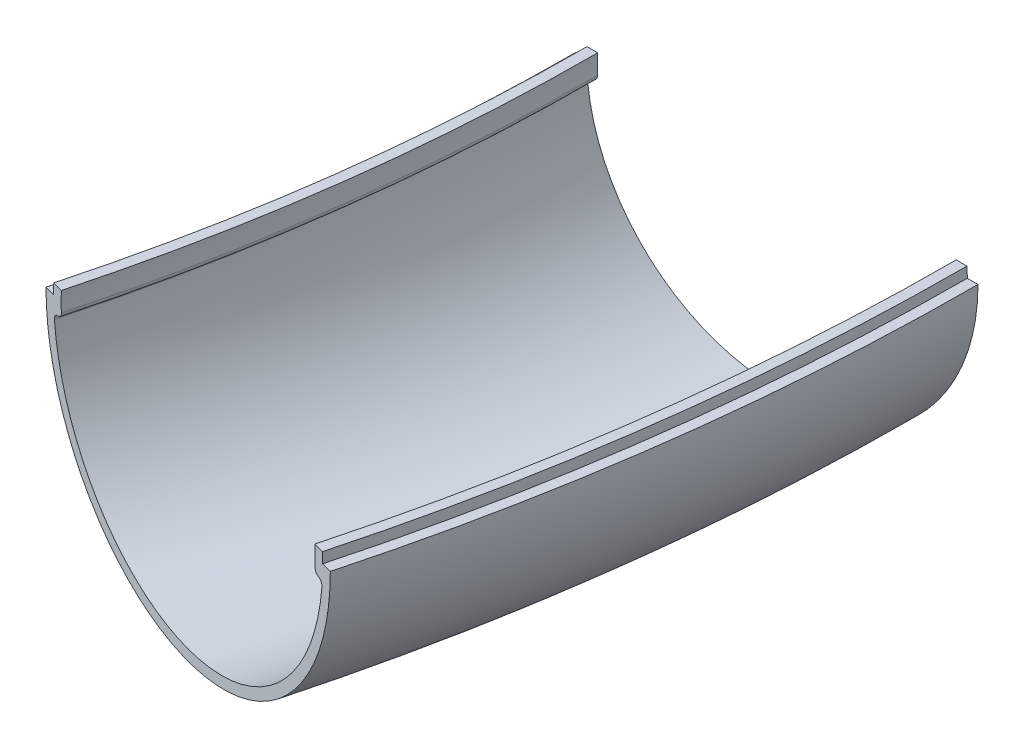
ISO-10303-21;
HEADER;
FILE_DESCRIPTION(('STEP AP214'),'2;1');
FILE_NAME('part.step','',(''),(''),'','','');
FILE_SCHEMA(('AUTOMOTIVE_DESIGN { 1 0 10303 214 1 1 1 1 }'));
ENDSEC;
DATA;
#1=APPLICATION_CONTEXT('core data for automotive mechanical design processes');
#2=APPLICATION_PROTOCOL_DEFINITION('international standard','automotive_design',2000,#1);
#3=PRODUCT_CONTEXT('',#1,'mechanical');
#4=PRODUCT('Part','Part','',(#3));
#5=PRODUCT_RELATED_PRODUCT_CATEGORY('part','',(#4));
#6=PRODUCT_DEFINITION_FORMATION('','',#4);
#7=PRODUCT_DEFINITION_CONTEXT('part definition',#1,'design');
#8=PRODUCT_DEFINITION('design','',#6,#7);
#9=PRODUCT_DEFINITION_SHAPE('','',#8);
#10=(LENGTH_UNIT() NAMED_UNIT(*) SI_UNIT(.MILLI.,.METRE.));
#11=(NAMED_UNIT(*) PLANE_ANGLE_UNIT() SI_UNIT($,.RADIAN.));
#12=(NAMED_UNIT(*) SI_UNIT($,.STERADIAN.) SOLID_ANGLE_UNIT());
#13=UNCERTAINTY_MEASURE_WITH_UNIT(LENGTH_MEASURE(1.E-05),#10,'distance_accuracy_value','');
#14=(GEOMETRIC_REPRESENTATION_CONTEXT(3) GLOBAL_UNCERTAINTY_ASSIGNED_CONTEXT((#13)) GLOBAL_UNIT_ASSIGNED_CONTEXT((#10,
#11,#12)) REPRESENTATION_CONTEXT('',''));
#15=CARTESIAN_POINT('',(0.,0.,0.));
#16=DIRECTION('',(0.,0.,1.));
#17=DIRECTION('',(1.,0.,0.));
#18=AXIS2_PLACEMENT_3D('',#15,#16,#17);
#19=CARTESIAN_POINT('',(0.,-1.10058393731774,0.));
#20=DIRECTION('',(0.,-1.,0.));
#21=DIRECTION('',(0.,0.,-1.));
#22=AXIS2_PLACEMENT_3D('',#19,#20,#21);
#23=PLANE('',#22);
#24=CARTESIAN_POINT('',(0.,-1.10058393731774,0.));
#25=DIRECTION('',(0.,1.,0.));
#26=DIRECTION('',(0.,0.,1.));
#27=AXIS2_PLACEMENT_3D('',#24,#25,#26);
#28=CIRCLE('',#27,163.718172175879);
#29=CARTESIAN_POINT('',(158.139610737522,-1.10058393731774,42.3733809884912));
#30=VERTEX_POINT('',#29);
#31=CARTESIAN_POINT('',(163.718172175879,-1.10058393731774,0.));
#32=VERTEX_POINT('',#31);
#33=EDGE_CURVE('E11',#30,#32,#28,.T.);
#34=ORIENTED_EDGE('',*,*,#33,.F.);
#35=DIRECTION('',(-0.965925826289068,0.,-0.258819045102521));
#36=VECTOR('',#35,1.);
#37=CARTESIAN_POINT('',(0.,-1.10058393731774,0.));
#38=LINE('',#37,#36);
#39=CARTESIAN_POINT('',(158.201461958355,-1.10058393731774,42.3899539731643));
#40=VERTEX_POINT('',#39);
#41=EDGE_CURVE('E231',#40,#30,#38,.T.);
#42=ORIENTED_EDGE('',*,*,#41,.F.);
#43=CARTESIAN_POINT('',(0.,-1.10058393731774,0.));
#44=DIRECTION('',(0.,1.,0.));
#45=DIRECTION('',(0.,0.,1.));
#46=AXIS2_PLACEMENT_3D('',#43,#44,#45);
#47=CIRCLE('',#46,163.782205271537);
#48=CARTESIAN_POINT('',(163.782205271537,-1.10058393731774,0.));
#49=VERTEX_POINT('',#48);
#50=EDGE_CURVE('E59',#40,#49,#47,.T.);
#51=ORIENTED_EDGE('',*,*,#50,.T.);
#52=DIRECTION('',(-1.,0.,0.));
#53=VECTOR('',#52,1.);
#54=CARTESIAN_POINT('',(0.,-1.10058393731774,0.));
#55=LINE('',#54,#53);
#56=EDGE_CURVE('E167',#49,#32,#55,.T.);
#57=ORIENTED_EDGE('',*,*,#56,.T.);
#58=EDGE_LOOP('',(#34,#42,#51,#57));
#59=FACE_BOUND('',#58,.T.);
#60=ADVANCED_FACE('F43',(#59),#23,.F.);
#61=CARTESIAN_POINT('',(0.,-1.50058393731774,0.));
#62=DIRECTION('',(0.,1.,0.));
#63=DIRECTION('',(0.,0.,1.));
#64=AXIS2_PLACEMENT_3D('',#61,#62,#63);
#65=TOROIDAL_SURFACE('',#64,163.718172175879,0.399999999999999);
#66=CARTESIAN_POINT('',(0.,-1.54407912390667,0.));
#67=DIRECTION('',(0.,1.,0.));
#68=DIRECTION('',(0.,0.,1.));
#69=AXIS2_PLACEMENT_3D('',#66,#67,#68);
#70=CIRCLE('',#69,164.11580035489);
#71=CARTESIAN_POINT('',(158.523690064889,-1.54407912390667,42.4762947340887));
#72=VERTEX_POINT('',#71);
#73=CARTESIAN_POINT('',(164.11580035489,-1.54407912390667,0.));
#74=VERTEX_POINT('',#73);
#75=EDGE_CURVE('E52',#72,#74,#70,.T.);
#76=ORIENTED_EDGE('',*,*,#75,.F.);
#77=CARTESIAN_POINT('',(158.139610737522,-1.50058393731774,42.3733809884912));
#78=DIRECTION('',(-0.258819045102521,0.,0.965925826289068));
#79=DIRECTION('',(0.965925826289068,0.,0.258819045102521));
#80=AXIS2_PLACEMENT_3D('',#77,#78,#79);
#81=CIRCLE('',#80,0.399999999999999);
#82=EDGE_CURVE('E163',#30,#72,#81,.F.);
#83=ORIENTED_EDGE('',*,*,#82,.F.);
#84=ORIENTED_EDGE('',*,*,#33,.T.);
#85=CARTESIAN_POINT('',(163.718172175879,-1.50058393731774,0.));
#86=DIRECTION('',(0.,0.,1.));
#87=DIRECTION('',(1.,0.,0.));
#88=AXIS2_PLACEMENT_3D('',#85,#86,#87);
#89=CIRCLE('',#88,0.399999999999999);
#90=EDGE_CURVE('E160',#32,#74,#89,.F.);
#91=ORIENTED_EDGE('',*,*,#90,.T.);
#92=EDGE_LOOP('',(#76,#83,#84,#91));
#93=FACE_BOUND('',#92,.T.);
#94=ADVANCED_FACE('F45',(#93),#65,.F.);
#95=CARTESIAN_POINT('',(0.,0.,0.));
#96=DIRECTION('',(0.,1.,0.));
#97=DIRECTION('',(0.,0.,1.));
#98=AXIS2_PLACEMENT_3D('',#95,#96,#97);
#99=TOROIDAL_SURFACE('',#98,150.,14.2);
#100=CARTESIAN_POINT('',(0.,-1.54407912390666,0.));
#101=DIRECTION('',(0.,1.,0.));
#102=DIRECTION('',(0.,0.,1.));
#103=AXIS2_PLACEMENT_3D('',#100,#101,#102);
#104=CIRCLE('',#103,135.88419964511);
#105=CARTESIAN_POINT('',(131.254057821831,-1.54407912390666,35.1694187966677));
#106=VERTEX_POINT('',#105);
#107=CARTESIAN_POINT('',(135.88419964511,-1.54407912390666,0.));
#108=VERTEX_POINT('',#107);
#109=EDGE_CURVE('E328',#106,#108,#104,.T.);
#110=ORIENTED_EDGE('',*,*,#109,.F.);
#111=CARTESIAN_POINT('',(144.88887394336,0.,38.8228567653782));
#112=DIRECTION('',(-0.258819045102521,0.,0.965925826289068));
#113=DIRECTION('',(0.965925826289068,0.,0.258819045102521));
#114=AXIS2_PLACEMENT_3D('',#111,#112,#113);
#115=CIRCLE('',#114,14.2);
#116=EDGE_CURVE('E236',#106,#72,#115,.T.);
#117=ORIENTED_EDGE('',*,*,#116,.T.);
#118=ORIENTED_EDGE('',*,*,#75,.T.);
#119=CARTESIAN_POINT('',(150.,0.,0.));
#120=DIRECTION('',(0.,0.,1.));
#121=DIRECTION('',(1.,0.,0.));
#122=AXIS2_PLACEMENT_3D('',#119,#120,#121);
#123=CIRCLE('',#122,14.2);
#124=EDGE_CURVE('E175',#108,#74,#123,.T.);
#125=ORIENTED_EDGE('',*,*,#124,.F.);
#126=EDGE_LOOP('',(#110,#117,#118,#125));
#127=FACE_BOUND('',#126,.T.);
#128=ADVANCED_FACE('F332',(#127),#99,.F.);
#129=CARTESIAN_POINT('',(0.,-1.50058393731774,0.));
#130=DIRECTION('',(0.,1.,0.));
#131=DIRECTION('',(0.,0.,1.));
#132=AXIS2_PLACEMENT_3D('',#129,#130,#131);
#133=TOROIDAL_SURFACE('',#132,136.281827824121,0.399999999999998);
#134=CARTESIAN_POINT('',(0.,-1.10058393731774,0.));
#135=DIRECTION('',(0.,1.,0.));
#136=DIRECTION('',(0.,0.,1.));
#137=AXIS2_PLACEMENT_3D('',#134,#135,#136);
#138=CIRCLE('',#137,136.281827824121);
#139=CARTESIAN_POINT('',(131.638137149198,-1.10058393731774,35.2723325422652));
#140=VERTEX_POINT('',#139);
#141=CARTESIAN_POINT('',(136.281827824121,-1.10058393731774,0.));
#142=VERTEX_POINT('',#141);
#143=EDGE_CURVE('E325',#140,#142,#138,.T.);
#144=ORIENTED_EDGE('',*,*,#143,.F.);
#145=CARTESIAN_POINT('',(131.638137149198,-1.50058393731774,35.2723325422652));
#146=DIRECTION('',(-0.258819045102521,0.,0.965925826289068));
#147=DIRECTION('',(0.965925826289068,0.,0.258819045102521));
#148=AXIS2_PLACEMENT_3D('',#145,#146,#147);
#149=CIRCLE('',#148,0.399999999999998);
#150=EDGE_CURVE('E240',#140,#106,#149,.T.);
#151=ORIENTED_EDGE('',*,*,#150,.T.);
#152=ORIENTED_EDGE('',*,*,#109,.T.);
#153=CARTESIAN_POINT('',(136.281827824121,-1.50058393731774,0.));
#154=DIRECTION('',(0.,0.,1.));
#155=DIRECTION('',(1.,0.,0.));
#156=AXIS2_PLACEMENT_3D('',#153,#154,#155);
#157=CIRCLE('',#156,0.399999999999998);
#158=EDGE_CURVE('E179',#142,#108,#157,.T.);
#159=ORIENTED_EDGE('',*,*,#158,.F.);
#160=EDGE_LOOP('',(#144,#151,#152,#159));
#161=FACE_BOUND('',#160,.T.);
#162=ADVANCED_FACE('F381',(#161),#133,.F.);
#163=CARTESIAN_POINT('',(0.,-1.10058393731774,0.));
#164=DIRECTION('',(0.,1.,0.));
#165=DIRECTION('',(0.,0.,1.));
#166=AXIS2_PLACEMENT_3D('',#163,#164,#165);
#167=PLANE('',#166);
#168=CARTESIAN_POINT('',(0.,-1.10058393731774,0.));
#169=DIRECTION('',(0.,1.,0.));
#170=DIRECTION('',(0.,0.,1.));
#171=AXIS2_PLACEMENT_3D('',#168,#169,#170);
#172=CIRCLE('',#171,136.217794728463);
#173=CARTESIAN_POINT('',(131.576285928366,-1.10058393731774,35.2557595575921));
#174=VERTEX_POINT('',#173);
#175=CARTESIAN_POINT('',(136.217794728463,-1.10058393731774,0.));
#176=VERTEX_POINT('',#175);
#177=EDGE_CURVE('E322',#174,#176,#172,.T.);
#178=ORIENTED_EDGE('',*,*,#177,.F.);
#179=DIRECTION('',(0.965925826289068,0.,0.258819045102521));
#180=VECTOR('',#179,1.);
#181=CARTESIAN_POINT('',(0.,-1.10058393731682,0.));
#182=LINE('',#181,#180);
#183=EDGE_CURVE('E244',#174,#140,#182,.T.);
#184=ORIENTED_EDGE('',*,*,#183,.T.);
#185=ORIENTED_EDGE('',*,*,#143,.T.);
#186=DIRECTION('',(1.,0.,0.));
#187=VECTOR('',#186,1.);
#188=CARTESIAN_POINT('',(0.,-1.10058393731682,0.));
#189=LINE('',#188,#187);
#190=EDGE_CURVE('E184',#176,#142,#189,.T.);
#191=ORIENTED_EDGE('',*,*,#190,.F.);
#192=EDGE_LOOP('',(#178,#184,#185,#191));
#193=FACE_BOUND('',#192,.T.);
#194=ADVANCED_FACE('F378',(#193),#167,.T.);
#195=CARTESIAN_POINT('',(0.,-0.70058393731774,0.));
#196=DIRECTION('',(0.,1.,0.));
#197=DIRECTION('',(0.,0.,1.));
#198=AXIS2_PLACEMENT_3D('',#195,#196,#197);
#199=TOROIDAL_SURFACE('',#198,136.217794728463,0.400000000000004);
#200=CARTESIAN_POINT('',(0.,-0.680277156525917,0.));
#201=DIRECTION('',(0.,1.,0.));
#202=DIRECTION('',(0.,0.,1.));
#203=AXIS2_PLACEMENT_3D('',#200,#201,#202);
#204=CIRCLE('',#203,136.617278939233);
#205=CARTESIAN_POINT('',(131.962158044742,-0.680277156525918,35.359153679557));
#206=VERTEX_POINT('',#205);
#207=CARTESIAN_POINT('',(136.617278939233,-0.680277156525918,0.));
#208=VERTEX_POINT('',#207);
#209=EDGE_CURVE('E319',#206,#208,#204,.T.);
#210=ORIENTED_EDGE('',*,*,#209,.F.);
#211=CARTESIAN_POINT('',(131.576285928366,-0.70058393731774,35.2557595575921));
#212=DIRECTION('',(-0.258819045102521,0.,0.965925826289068));
#213=DIRECTION('',(0.965925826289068,0.,0.258819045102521));
#214=AXIS2_PLACEMENT_3D('',#211,#212,#213);
#215=CIRCLE('',#214,0.400000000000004);
#216=EDGE_CURVE('E248',#206,#174,#215,.F.);
#217=ORIENTED_EDGE('',*,*,#216,.T.);
#218=ORIENTED_EDGE('',*,*,#177,.T.);
#219=CARTESIAN_POINT('',(136.217794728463,-0.70058393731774,0.));
#220=DIRECTION('',(0.,0.,1.));
#221=DIRECTION('',(1.,0.,0.));
#222=AXIS2_PLACEMENT_3D('',#219,#220,#221);
#223=CIRCLE('',#222,0.400000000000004);
#224=EDGE_CURVE('E188',#208,#176,#223,.F.);
#225=ORIENTED_EDGE('',*,*,#224,.F.);
#226=EDGE_LOOP('',(#210,#217,#218,#225));
#227=FACE_BOUND('',#226,.T.);
#228=ADVANCED_FACE('F374',(#227),#199,.T.);
#229=CARTESIAN_POINT('',(0.,0.,0.));
#230=DIRECTION('',(0.,1.,0.));
#231=DIRECTION('',(0.,0.,1.));
#232=AXIS2_PLACEMENT_3D('',#229,#230,#231);
#233=TOROIDAL_SURFACE('',#232,150.,13.4);
#234=CARTESIAN_POINT('',(0.,0.776811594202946,0.));
#235=DIRECTION('',(0.,1.,0.));
#236=DIRECTION('',(0.,0.,1.));
#237=AXIS2_PLACEMENT_3D('',#234,#235,#236);
#238=CIRCLE('',#237,136.622535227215);
#239=CARTESIAN_POINT('',(131.967235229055,0.776811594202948,35.3605141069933));
#240=VERTEX_POINT('',#239);
#241=CARTESIAN_POINT('',(136.622535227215,0.776811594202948,0.));
#242=VERTEX_POINT('',#241);
#243=EDGE_CURVE('E316',#240,#242,#238,.T.);
#244=ORIENTED_EDGE('',*,*,#243,.F.);
#245=CARTESIAN_POINT('',(144.88887394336,0.,38.8228567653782));
#246=DIRECTION('',(-0.258819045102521,0.,0.965925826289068));
#247=DIRECTION('',(0.965925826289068,0.,0.258819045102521));
#248=AXIS2_PLACEMENT_3D('',#245,#246,#247);
#249=CIRCLE('',#248,13.4);
#250=EDGE_CURVE('E252',#240,#206,#249,.T.);
#251=ORIENTED_EDGE('',*,*,#250,.T.);
#252=ORIENTED_EDGE('',*,*,#209,.T.);
#253=CARTESIAN_POINT('',(150.,0.,0.));
#254=DIRECTION('',(0.,0.,1.));
#255=DIRECTION('',(1.,0.,0.));
#256=AXIS2_PLACEMENT_3D('',#253,#254,#255);
#257=CIRCLE('',#256,13.4);
#258=EDGE_CURVE('E192',#242,#208,#257,.T.);
#259=ORIENTED_EDGE('',*,*,#258,.F.);
#260=EDGE_LOOP('',(#244,#251,#252,#259));
#261=FACE_BOUND('',#260,.T.);
#262=ADVANCED_FACE('F370',(#261),#233,.F.);
#263=CARTESIAN_POINT('',(0.,0.776811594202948,0.));
#264=DIRECTION('',(0.,1.,0.));
#265=DIRECTION('',(0.,0.,1.));
#266=AXIS2_PLACEMENT_3D('',#263,#264,#265);
#267=PLANE('',#266);
#268=CARTESIAN_POINT('',(0.,0.776811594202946,0.));
#269=DIRECTION('',(0.,1.,0.));
#270=DIRECTION('',(0.,0.,1.));
#271=AXIS2_PLACEMENT_3D('',#268,#269,#270);
#272=CIRCLE('',#271,135.821263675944);
#273=CARTESIAN_POINT('',(131.193266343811,0.776811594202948,35.1531297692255));
#274=VERTEX_POINT('',#273);
#275=CARTESIAN_POINT('',(135.821263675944,0.776811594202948,0.));
#276=VERTEX_POINT('',#275);
#277=EDGE_CURVE('E313',#274,#276,#272,.T.);
#278=ORIENTED_EDGE('',*,*,#277,.F.);
#279=DIRECTION('',(0.965925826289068,0.,0.258819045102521));
#280=VECTOR('',#279,1.);
#281=CARTESIAN_POINT('',(0.,0.77681159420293,0.));
#282=LINE('',#281,#280);
#283=EDGE_CURVE('E256',#274,#240,#282,.T.);
#284=ORIENTED_EDGE('',*,*,#283,.T.);
#285=ORIENTED_EDGE('',*,*,#243,.T.);
#286=DIRECTION('',(1.,0.,0.));
#287=VECTOR('',#286,1.);
#288=CARTESIAN_POINT('',(0.,0.77681159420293,0.));
#289=LINE('',#288,#287);
#290=EDGE_CURVE('E196',#276,#242,#289,.T.);
#291=ORIENTED_EDGE('',*,*,#290,.F.);
#292=EDGE_LOOP('',(#278,#284,#285,#291));
#293=FACE_BOUND('',#292,.T.);
#294=ADVANCED_FACE('F366',(#293),#267,.T.);
#295=CARTESIAN_POINT('',(0.,0.,0.));
#296=DIRECTION('',(0.,1.,0.));
#297=DIRECTION('',(0.,0.,1.));
#298=AXIS2_PLACEMENT_3D('',#295,#296,#297);
#299=TOROIDAL_SURFACE('',#298,150.,14.2);
#300=CARTESIAN_POINT('',(0.,0.,0.));
#301=DIRECTION('',(0.,1.,0.));
#302=DIRECTION('',(0.,0.,1.));
#303=AXIS2_PLACEMENT_3D('',#300,#301,#302);
#304=CIRCLE('',#303,135.8);
#305=CARTESIAN_POINT('',(131.172727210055,0.,35.1476263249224));
#306=VERTEX_POINT('',#305);
#307=CARTESIAN_POINT('',(135.8,0.,0.));
#308=VERTEX_POINT('',#307);
#309=EDGE_CURVE('E310',#306,#308,#304,.T.);
#310=ORIENTED_EDGE('',*,*,#309,.F.);
#311=CARTESIAN_POINT('',(144.88887394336,0.,38.8228567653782));
#312=DIRECTION('',(-0.258819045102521,0.,0.965925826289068));
#313=DIRECTION('',(0.965925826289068,0.,0.258819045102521));
#314=AXIS2_PLACEMENT_3D('',#311,#312,#313);
#315=CIRCLE('',#314,14.2);
#316=EDGE_CURVE('E260',#274,#306,#315,.T.);
#317=ORIENTED_EDGE('',*,*,#316,.F.);
#318=ORIENTED_EDGE('',*,*,#277,.T.);
#319=CARTESIAN_POINT('',(150.,0.,0.));
#320=DIRECTION('',(0.,0.,1.));
#321=DIRECTION('',(1.,0.,0.));
#322=AXIS2_PLACEMENT_3D('',#319,#320,#321);
#323=CIRCLE('',#322,14.2);
#324=EDGE_CURVE('E200',#276,#308,#323,.T.);
#325=ORIENTED_EDGE('',*,*,#324,.T.);
#326=EDGE_LOOP('',(#310,#317,#318,#325));
#327=FACE_BOUND('',#326,.T.);
#328=ADVANCED_FACE('F362',(#327),#299,.T.);
#329=CARTESIAN_POINT('',(0.,0.,0.));
#330=DIRECTION('',(0.,1.,0.));
#331=DIRECTION('',(0.,0.,1.));
#332=AXIS2_PLACEMENT_3D('',#329,#330,#331);
#333=PLANE('',#332);
#334=CARTESIAN_POINT('',(0.,0.,0.));
#335=DIRECTION('',(0.,1.,0.));
#336=DIRECTION('',(0.,0.,1.));
#337=AXIS2_PLACEMENT_3D('',#334,#335,#336);
#338=CIRCLE('',#337,135.);
#339=CARTESIAN_POINT('',(130.399986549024,0.,34.9405710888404));
#340=VERTEX_POINT('',#339);
#341=CARTESIAN_POINT('',(135.,0.,0.));
#342=VERTEX_POINT('',#341);
#343=EDGE_CURVE('E307',#340,#342,#338,.T.);
#344=ORIENTED_EDGE('',*,*,#343,.F.);
#345=DIRECTION('',(0.965925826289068,0.,0.258819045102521));
#346=VECTOR('',#345,1.);
#347=CARTESIAN_POINT('',(0.,0.,0.));
#348=LINE('',#347,#346);
#349=EDGE_CURVE('E264',#340,#306,#348,.T.);
#350=ORIENTED_EDGE('',*,*,#349,.T.);
#351=ORIENTED_EDGE('',*,*,#309,.T.);
#352=DIRECTION('',(1.,0.,0.));
#353=VECTOR('',#352,1.);
#354=CARTESIAN_POINT('',(0.,0.,0.));
#355=LINE('',#354,#353);
#356=EDGE_CURVE('E204',#342,#308,#355,.T.);
#357=ORIENTED_EDGE('',*,*,#356,.F.);
#358=EDGE_LOOP('',(#344,#350,#351,#357));
#359=FACE_BOUND('',#358,.T.);
#360=ADVANCED_FACE('F359',(#359),#333,.T.);
#361=CARTESIAN_POINT('',(0.,0.,0.));
#362=DIRECTION('',(0.,1.,0.));
#363=DIRECTION('',(0.,0.,1.));
#364=AXIS2_PLACEMENT_3D('',#361,#362,#363);
#365=TOROIDAL_SURFACE('',#364,150.,15.);
#366=CARTESIAN_POINT('',(0.,-1.80411241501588E-13,0.));
#367=DIRECTION('',(0.,1.,0.));
#368=DIRECTION('',(0.,0.,1.));
#369=AXIS2_PLACEMENT_3D('',#366,#367,#368);
#370=CIRCLE('',#369,165.);
#371=CARTESIAN_POINT('',(159.377761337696,-1.79334215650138E-13,42.705142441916));
#372=VERTEX_POINT('',#371);
#373=CARTESIAN_POINT('',(165.,-1.79334215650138E-13,0.));
#374=VERTEX_POINT('',#373);
#375=EDGE_CURVE('E304',#372,#374,#370,.T.);
#376=ORIENTED_EDGE('',*,*,#375,.F.);
#377=CARTESIAN_POINT('',(144.88887394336,0.,38.8228567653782));
#378=DIRECTION('',(-0.258819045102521,0.,0.965925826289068));
#379=DIRECTION('',(0.965925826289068,0.,0.258819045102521));
#380=AXIS2_PLACEMENT_3D('',#377,#378,#379);
#381=CIRCLE('',#380,15.);
#382=EDGE_CURVE('E268',#340,#372,#381,.T.);
#383=ORIENTED_EDGE('',*,*,#382,.F.);
#384=ORIENTED_EDGE('',*,*,#343,.T.);
#385=CARTESIAN_POINT('',(150.,0.,0.));
#386=DIRECTION('',(0.,0.,1.));
#387=DIRECTION('',(1.,0.,0.));
#388=AXIS2_PLACEMENT_3D('',#385,#386,#387);
#389=CIRCLE('',#388,15.);
#390=EDGE_CURVE('E208',#342,#374,#389,.T.);
#391=ORIENTED_EDGE('',*,*,#390,.T.);
#392=EDGE_LOOP('',(#376,#383,#384,#391));
#393=FACE_BOUND('',#392,.T.);
#394=ADVANCED_FACE('F355',(#393),#365,.T.);
#395=CARTESIAN_POINT('',(0.,-1.78899466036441E-13,0.));
#396=DIRECTION('',(0.,1.,0.));
#397=DIRECTION('',(0.,0.,1.));
#398=AXIS2_PLACEMENT_3D('',#395,#396,#397);
#399=PLANE('',#398);
#400=CARTESIAN_POINT('',(0.,-1.80411241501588E-13,0.));
#401=DIRECTION('',(0.,1.,0.));
#402=DIRECTION('',(0.,0.,1.));
#403=AXIS2_PLACEMENT_3D('',#400,#401,#402);
#404=CIRCLE('',#403,164.2);
#405=CARTESIAN_POINT('',(158.605020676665,-1.78464716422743E-13,42.498087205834));
#406=VERTEX_POINT('',#405);
#407=CARTESIAN_POINT('',(164.2,-1.78464716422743E-13,0.));
#408=VERTEX_POINT('',#407);
#409=EDGE_CURVE('E301',#406,#408,#404,.T.);
#410=ORIENTED_EDGE('',*,*,#409,.F.);
#411=DIRECTION('',(0.965925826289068,0.,0.258819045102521));
#412=VECTOR('',#411,1.);
#413=CARTESIAN_POINT('',(0.,0.,0.));
#414=LINE('',#413,#412);
#415=EDGE_CURVE('E272',#406,#372,#414,.T.);
#416=ORIENTED_EDGE('',*,*,#415,.T.);
#417=ORIENTED_EDGE('',*,*,#375,.T.);
#418=DIRECTION('',(1.,0.,0.));
#419=VECTOR('',#418,1.);
#420=CARTESIAN_POINT('',(0.,0.,0.));
#421=LINE('',#420,#419);
#422=EDGE_CURVE('E212',#408,#374,#421,.T.);
#423=ORIENTED_EDGE('',*,*,#422,.F.);
#424=EDGE_LOOP('',(#410,#416,#417,#423));
#425=FACE_BOUND('',#424,.T.);
#426=ADVANCED_FACE('F350',(#425),#399,.T.);
#427=CARTESIAN_POINT('',(0.,0.,0.));
#428=DIRECTION('',(0.,1.,0.));
#429=DIRECTION('',(0.,0.,1.));
#430=AXIS2_PLACEMENT_3D('',#427,#428,#429);
#431=TOROIDAL_SURFACE('',#430,150.,14.2);
#432=CARTESIAN_POINT('',(0.,0.776811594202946,0.));
#433=DIRECTION('',(0.,1.,0.));
#434=DIRECTION('',(0.,0.,1.));
#435=AXIS2_PLACEMENT_3D('',#432,#433,#434);
#436=CIRCLE('',#435,164.178736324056);
#437=CARTESIAN_POINT('',(158.584481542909,0.776811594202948,42.4925837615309));
#438=VERTEX_POINT('',#437);
#439=CARTESIAN_POINT('',(164.178736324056,0.776811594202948,0.));
#440=VERTEX_POINT('',#439);
#441=EDGE_CURVE('E298',#438,#440,#436,.T.);
#442=ORIENTED_EDGE('',*,*,#441,.F.);
#443=CARTESIAN_POINT('',(144.88887394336,0.,38.8228567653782));
#444=DIRECTION('',(-0.258819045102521,0.,0.965925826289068));
#445=DIRECTION('',(0.965925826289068,0.,0.258819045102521));
#446=AXIS2_PLACEMENT_3D('',#443,#444,#445);
#447=CIRCLE('',#446,14.2);
#448=EDGE_CURVE('E276',#406,#438,#447,.T.);
#449=ORIENTED_EDGE('',*,*,#448,.F.);
#450=ORIENTED_EDGE('',*,*,#409,.T.);
#451=CARTESIAN_POINT('',(150.,0.,0.));
#452=DIRECTION('',(0.,0.,1.));
#453=DIRECTION('',(1.,0.,0.));
#454=AXIS2_PLACEMENT_3D('',#451,#452,#453);
#455=CIRCLE('',#454,14.2);
#456=EDGE_CURVE('E216',#408,#440,#455,.T.);
#457=ORIENTED_EDGE('',*,*,#456,.T.);
#458=EDGE_LOOP('',(#442,#449,#450,#457));
#459=FACE_BOUND('',#458,.T.);
#460=ADVANCED_FACE('F346',(#459),#431,.T.);
#461=CARTESIAN_POINT('',(0.,0.77681159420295,0.));
#462=DIRECTION('',(0.,1.,0.));
#463=DIRECTION('',(0.,0.,1.));
#464=AXIS2_PLACEMENT_3D('',#461,#462,#463);
#465=PLANE('',#464);
#466=CARTESIAN_POINT('',(0.,0.776811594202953,0.));
#467=DIRECTION('',(0.,1.,0.));
#468=DIRECTION('',(0.,0.,1.));
#469=AXIS2_PLACEMENT_3D('',#466,#467,#468);
#470=CIRCLE('',#469,163.377464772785);
#471=CARTESIAN_POINT('',(157.810512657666,0.776811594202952,42.2851994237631));
#472=VERTEX_POINT('',#471);
#473=CARTESIAN_POINT('',(163.377464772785,0.776811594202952,0.));
#474=VERTEX_POINT('',#473);
#475=EDGE_CURVE('E295',#472,#474,#470,.T.);
#476=ORIENTED_EDGE('',*,*,#475,.F.);
#477=DIRECTION('',(0.965925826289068,0.,0.258819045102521));
#478=VECTOR('',#477,1.);
#479=CARTESIAN_POINT('',(0.,0.776811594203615,0.));
#480=LINE('',#479,#478);
#481=EDGE_CURVE('E280',#472,#438,#480,.T.);
#482=ORIENTED_EDGE('',*,*,#481,.T.);
#483=ORIENTED_EDGE('',*,*,#441,.T.);
#484=DIRECTION('',(1.,0.,0.));
#485=VECTOR('',#484,1.);
#486=CARTESIAN_POINT('',(0.,0.776811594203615,0.));
#487=LINE('',#486,#485);
#488=EDGE_CURVE('E220',#474,#440,#487,.T.);
#489=ORIENTED_EDGE('',*,*,#488,.F.);
#490=EDGE_LOOP('',(#476,#482,#483,#489));
#491=FACE_BOUND('',#490,.T.);
#492=ADVANCED_FACE('F343',(#491),#465,.T.);
#493=CARTESIAN_POINT('',(0.,0.,0.));
#494=DIRECTION('',(0.,1.,0.));
#495=DIRECTION('',(0.,0.,1.));
#496=AXIS2_PLACEMENT_3D('',#493,#494,#495);
#497=TOROIDAL_SURFACE('',#496,150.,13.4);
#498=CARTESIAN_POINT('',(0.,-0.680277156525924,0.));
#499=DIRECTION('',(0.,1.,0.));
#500=DIRECTION('',(0.,0.,1.));
#501=AXIS2_PLACEMENT_3D('',#498,#499,#500);
#502=CIRCLE('',#501,163.382721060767);
#503=CARTESIAN_POINT('',(157.815589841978,-0.680277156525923,42.2865598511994));
#504=VERTEX_POINT('',#503);
#505=CARTESIAN_POINT('',(163.382721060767,-0.680277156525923,0.));
#506=VERTEX_POINT('',#505);
#507=EDGE_CURVE('E67',#504,#506,#502,.T.);
#508=ORIENTED_EDGE('',*,*,#507,.F.);
#509=CARTESIAN_POINT('',(144.88887394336,0.,38.8228567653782));
#510=DIRECTION('',(-0.258819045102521,0.,0.965925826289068));
#511=DIRECTION('',(0.965925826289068,0.,0.258819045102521));
#512=AXIS2_PLACEMENT_3D('',#509,#510,#511);
#513=CIRCLE('',#512,13.4);
#514=EDGE_CURVE('E284',#504,#472,#513,.T.);
#515=ORIENTED_EDGE('',*,*,#514,.T.);
#516=ORIENTED_EDGE('',*,*,#475,.T.);
#517=CARTESIAN_POINT('',(150.,0.,0.));
#518=DIRECTION('',(0.,0.,1.));
#519=DIRECTION('',(1.,0.,0.));
#520=AXIS2_PLACEMENT_3D('',#517,#518,#519);
#521=CIRCLE('',#520,13.4);
#522=EDGE_CURVE('E224',#506,#474,#521,.T.);
#523=ORIENTED_EDGE('',*,*,#522,.F.);
#524=EDGE_LOOP('',(#508,#515,#516,#523));
#525=FACE_BOUND('',#524,.T.);
#526=ADVANCED_FACE('F339',(#525),#497,.F.);
#527=CARTESIAN_POINT('',(0.,-0.700583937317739,0.));
#528=DIRECTION('',(0.,1.,0.));
#529=DIRECTION('',(0.,0.,1.));
#530=AXIS2_PLACEMENT_3D('',#527,#528,#529);
#531=TOROIDAL_SURFACE('',#530,163.782205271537,0.400000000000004);
#532=CARTESIAN_POINT('',(158.201461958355,-0.700583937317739,42.3899539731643));
#533=DIRECTION('',(-0.258819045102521,0.,0.965925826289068));
#534=DIRECTION('',(0.965925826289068,0.,0.258819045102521));
#535=AXIS2_PLACEMENT_3D('',#532,#533,#534);
#536=CIRCLE('',#535,0.400000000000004);
#537=EDGE_CURVE('E287',#504,#40,#536,.T.);
#538=ORIENTED_EDGE('',*,*,#537,.F.);
#539=ORIENTED_EDGE('',*,*,#507,.T.);
#540=CARTESIAN_POINT('',(163.782205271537,-0.700583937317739,0.));
#541=DIRECTION('',(0.,0.,1.));
#542=DIRECTION('',(1.,0.,0.));
#543=AXIS2_PLACEMENT_3D('',#540,#541,#542);
#544=CIRCLE('',#543,0.400000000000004);
#545=EDGE_CURVE('E228',#506,#49,#544,.T.);
#546=ORIENTED_EDGE('',*,*,#545,.T.);
#547=ORIENTED_EDGE('',*,*,#50,.F.);
#548=EDGE_LOOP('',(#538,#539,#546,#547));
#549=FACE_BOUND('',#548,.T.);
#550=ADVANCED_FACE('F338',(#549),#531,.T.);
#551=CARTESIAN_POINT('',(0.,0.,0.));
#552=DIRECTION('',(-0.258819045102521,0.,0.965925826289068));
#553=DIRECTION('',(0.965925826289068,0.,0.258819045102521));
#554=AXIS2_PLACEMENT_3D('',#551,#552,#553);
#555=PLANE('',#554);
#556=ORIENTED_EDGE('',*,*,#41,.T.);
#557=ORIENTED_EDGE('',*,*,#82,.T.);
#558=ORIENTED_EDGE('',*,*,#116,.F.);
#559=ORIENTED_EDGE('',*,*,#150,.F.);
#560=ORIENTED_EDGE('',*,*,#183,.F.);
#561=ORIENTED_EDGE('',*,*,#216,.F.);
#562=ORIENTED_EDGE('',*,*,#250,.F.);
#563=ORIENTED_EDGE('',*,*,#283,.F.);
#564=ORIENTED_EDGE('',*,*,#316,.T.);
#565=ORIENTED_EDGE('',*,*,#349,.F.);
#566=ORIENTED_EDGE('',*,*,#382,.T.);
#567=ORIENTED_EDGE('',*,*,#415,.F.);
#568=ORIENTED_EDGE('',*,*,#448,.T.);
#569=ORIENTED_EDGE('',*,*,#481,.F.);
#570=ORIENTED_EDGE('',*,*,#514,.F.);
#571=ORIENTED_EDGE('',*,*,#537,.T.);
#572=EDGE_LOOP('',(#556,#557,#558,#559,#560,#561,#562,#563,#564,#565,#566,#567,#568,#569,#570,#571));
#573=FACE_BOUND('',#572,.T.);
#574=ADVANCED_FACE('F335',(#573),#555,.T.);
#575=CARTESIAN_POINT('',(0.,0.,0.));
#576=DIRECTION('',(0.,0.,1.));
#577=DIRECTION('',(1.,0.,0.));
#578=AXIS2_PLACEMENT_3D('',#575,#576,#577);
#579=PLANE('',#578);
#580=ORIENTED_EDGE('',*,*,#56,.F.);
#581=ORIENTED_EDGE('',*,*,#545,.F.);
#582=ORIENTED_EDGE('',*,*,#522,.T.);
#583=ORIENTED_EDGE('',*,*,#488,.T.);
#584=ORIENTED_EDGE('',*,*,#456,.F.);
#585=ORIENTED_EDGE('',*,*,#422,.T.);
#586=ORIENTED_EDGE('',*,*,#390,.F.);
#587=ORIENTED_EDGE('',*,*,#356,.T.);
#588=ORIENTED_EDGE('',*,*,#324,.F.);
#589=ORIENTED_EDGE('',*,*,#290,.T.);
#590=ORIENTED_EDGE('',*,*,#258,.T.);
#591=ORIENTED_EDGE('',*,*,#224,.T.);
#592=ORIENTED_EDGE('',*,*,#190,.T.);
#593=ORIENTED_EDGE('',*,*,#158,.T.);
#594=ORIENTED_EDGE('',*,*,#124,.T.);
#595=ORIENTED_EDGE('',*,*,#90,.F.);
#596=EDGE_LOOP('',(#580,#581,#582,#583,#584,#585,#586,#587,#588,#589,#590,#591,#592,#593,#594,#595));
#597=FACE_BOUND('',#596,.T.);
#598=ADVANCED_FACE('F172',(#597),#579,.F.);
#599=CLOSED_SHELL('',(#60,#94,#128,#162,#194,#228,#262,#294,#328,#360,#394,#426,#460,#492,#526,
#550,#574,#598));
#600=MANIFOLD_SOLID_BREP('B2',#599);
#601=ADVANCED_BREP_SHAPE_REPRESENTATION('',(#18,#600),#14);
#602=SHAPE_DEFINITION_REPRESENTATION(#9,#601);
ENDSEC;
END-ISO-10303-21;
